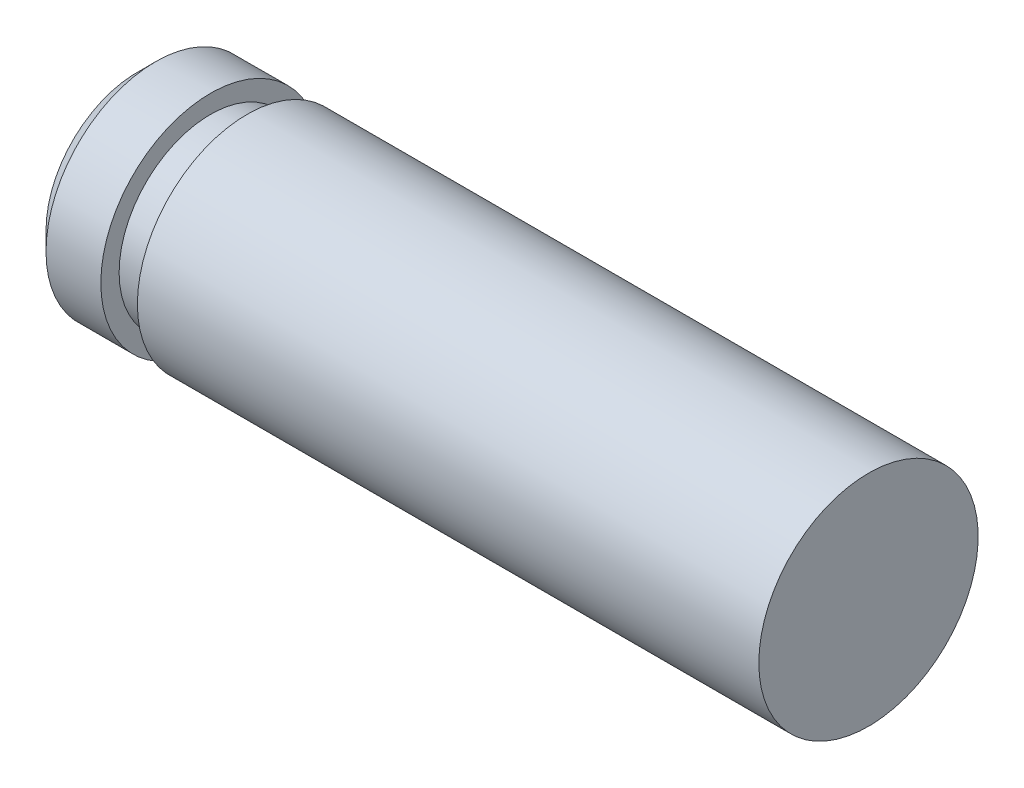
from build123d import *

# Parameters (mm, degrees)
CHANFREIN1_SIZE = 0.5


with BuildPart() as part:
    # Esquisse1 → R_volution1 (revolve)
    with BuildSketch(Plane.XY, mode=Mode.PRIVATE) as r_volution1_sk:
        Polygon((0, 0), (0, 3), (2, 3), (2, 2.5), (3, 2.5), (3, 3), (20, 3), (20, 0), align=None)
    revolve(r_volution1_sk.sketch.rotate(Axis((-29.010211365, 0, 0), (1, 0, 0)), 90), axis=Axis((-29.010211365, 0, 0), (1, 0, 0)))

    # Chanfrein1
    chanfrein1_edges = [part.edges().sort_by_distance(p)[0] for p in [
        (0, 0, -3),
    ]]
    chamfer(chanfrein1_edges, length=CHANFREIN1_SIZE)


solid = part.part
